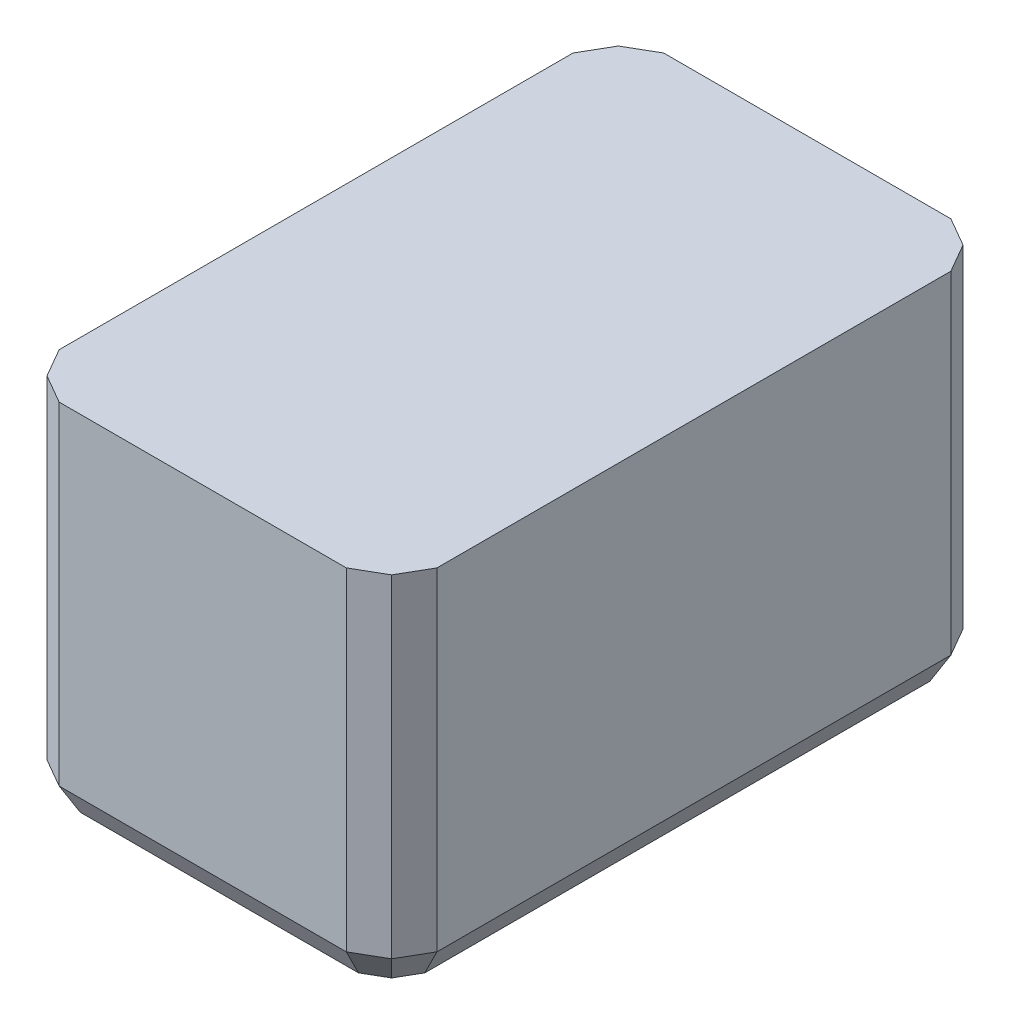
from build123d import *

# Parameters (mm, degrees)
LINEAR_AUSTRAGEN1_DEPTH = 500


with BuildPart() as part:
    # Skizze1 → Linear austragen1 (new body)
    with BuildSketch(Plane(origin=(0, 0, 0), x_dir=(1, 0, 0), z_dir=(0, 1, 0))):
        Polygon((-250, 340), (-250, -340), (-228.038475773, -378.038475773), (-190, -400), (190, -400), (228.038475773, -378.038475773), (250, -340), (250, 340), (228.038475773, 378.038475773), (190, 400), (-190, 400), (-228.038475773, 378.038475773), align=None)
    extrude(amount=LINEAR_AUSTRAGEN1_DEPTH)

    # Schnitt-Austragung2: sweep along a path in Skizze3
    with BuildLine(Plane.XZ) as schnitt_austragung2_path:
        Line((-250, -340), (-228.038475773, -378.038475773))
        Line((-228.038475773, -378.038475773), (-190, -400))
        Line((-190, -400), (190, -400))
        Line((190, -400), (228.038475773, -378.038475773))
        Line((228.038475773, -378.038475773), (250, -340))
        Line((250, -340), (250, 340))
        Line((250, 340), (228.038475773, 378.038475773))
        Line((228.038475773, 378.038475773), (190, 400))
        Line((190, 400), (-190, 400))
        Line((-190, 400), (-228.038475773, 378.038475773))
        Line((-228.038475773, 378.038475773), (-250, 340))
        Line((-250, 340), (-250, -340))
    # Skizze2 → Schnitt-Austragung2 (sweep, cut)
    with BuildSketch(Plane(origin=(0, 0, -340), x_dir=(-1, 0, 0), z_dir=(0, 0, -1))):
        Polygon((-250, 60), (-228.038475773, 21.961524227), (-190, 0), (-250, 0), align=None)
    sweep(path=schnitt_austragung2_path.line, transition=Transition.RIGHT, mode=Mode.SUBTRACT)


solid = part.part
